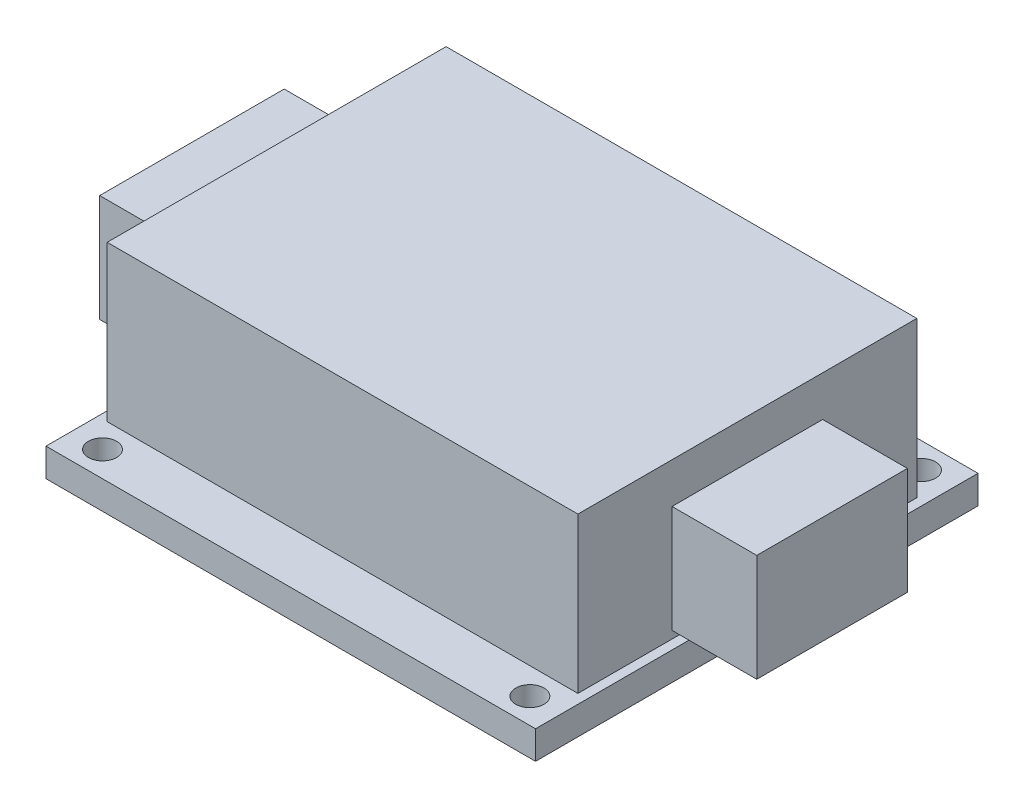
from build123d import *

# Parameters (mm, degrees)
SKETCH_1_W      = 52
SKETCH_1_H      = 47
SKETCH_1_R      = 1.5
EXTRUDE_1_DEPTH = 3
SKETCH_2_W      = 50
SKETCH_2_H      = 36
EXTRUDE_2_DEPTH = 16.5
SKETCH_4_W      = 16
SKETCH_4_H      = 11.4
EXTRUDE_4_DEPTH = 9
SKETCH_5_W      = 19.6
SKETCH_5_H      = 11.4
EXTRUDE_5_DEPTH = 9


with BuildPart() as part:
    # Sketch 1 → Extrude 1 (new body)
    with BuildSketch(Plane(origin=(0, 0, 0), x_dir=(1, 0, 0), z_dir=(0, 1, 0))):
        Rectangle(SKETCH_1_W, SKETCH_1_H)
        with Locations(Location((-22.7, 20.8, 0), (0, 0, 270))):
            Circle(SKETCH_1_R, mode=Mode.SUBTRACT)
        with Locations(Location((-22.7, -20.8, 0), (0, 0, 270))):
            Circle(SKETCH_1_R, mode=Mode.SUBTRACT)
        with Locations(Location((22.7, -20.8, 0), (0, 0, 90))):
            Circle(SKETCH_1_R, mode=Mode.SUBTRACT)
        with Locations(Location((22.7, 20.8, 0), (0, 0, 90))):
            Circle(SKETCH_1_R, mode=Mode.SUBTRACT)
    extrude(amount=EXTRUDE_1_DEPTH)

    # Sketch 2 → Extrude 2 (add)
    with BuildSketch(Plane(origin=(0, 3, 0), x_dir=(1, 0, 0), z_dir=(0, 1, 0))):
        Rectangle(SKETCH_2_W, SKETCH_2_H)
    extrude(amount=EXTRUDE_2_DEPTH)

    # Sketch 4 → Extrude 4 (add)
    with BuildSketch(Plane(origin=(25, 0, 0), x_dir=(0, 0, -1), z_dir=(1, 0, 0))):
        with Locations((0, 9.5)):
            Rectangle(SKETCH_4_W, SKETCH_4_H)
    extrude(amount=EXTRUDE_4_DEPTH)

    # Sketch 5 → Extrude 5 (add)
    with BuildSketch(Plane.ZY.offset(25)):
        with Locations((0, 9.5)):
            Rectangle(SKETCH_5_W, SKETCH_5_H)
    extrude(amount=EXTRUDE_5_DEPTH)


solid = part.part
